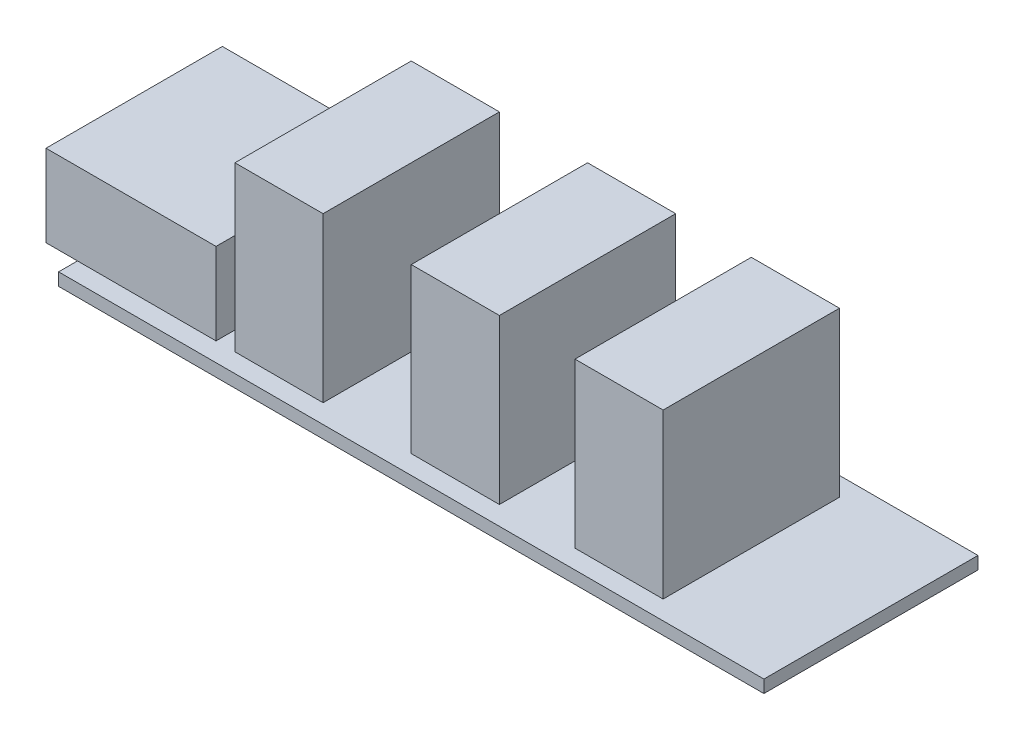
from build123d import *

# Parameters (mm, degrees)
SKETCH1_W           = 56
SKETCH1_H           = 17
BOSS_EXTRUDE1_DEPTH = 1
SKETCH2_W           = 13.5
SKETCH2_H           = 14
BOSS_EXTRUDE2_DEPTH = 6.5
SKETCH3_W           = 7
SKETCH3_H           = 14
BOSS_EXTRUDE3_DEPTH = 13


with BuildPart() as part:
    # Sketch1 → Boss-Extrude1 (new body)
    with BuildSketch(Plane(origin=(0, 0, 0), x_dir=(1, 0, 0), z_dir=(0, 1, 0))):
        with Locations((28, 8.5)):
            Rectangle(SKETCH1_W, SKETCH1_H)
    extrude(amount=BOSS_EXTRUDE1_DEPTH)

    # Sketch2 → Boss-Extrude2 (add)
    with BuildSketch(Plane(origin=(0, 1, 0), x_dir=(1, 0, 0), z_dir=(0, 1, 0))):
        with Locations((4.25, 8.5)):
            Rectangle(SKETCH2_W, SKETCH2_H)
    extrude(amount=BOSS_EXTRUDE2_DEPTH)

    # Sketch3 → Boss-Extrude3 (add)
    with BuildSketch(Plane(origin=(0, 1, 0), x_dir=(1, 0, 0), z_dir=(0, 1, 0))):
        with Locations((16, 8.5)):
            Rectangle(SKETCH3_W, SKETCH3_H)
        with Locations((30, 8.5)):
            Rectangle(SKETCH3_W, SKETCH3_H)
        with Locations((43, 8.5)):
            Rectangle(SKETCH3_W, SKETCH3_H)
    extrude(amount=BOSS_EXTRUDE3_DEPTH)


solid = part.part
